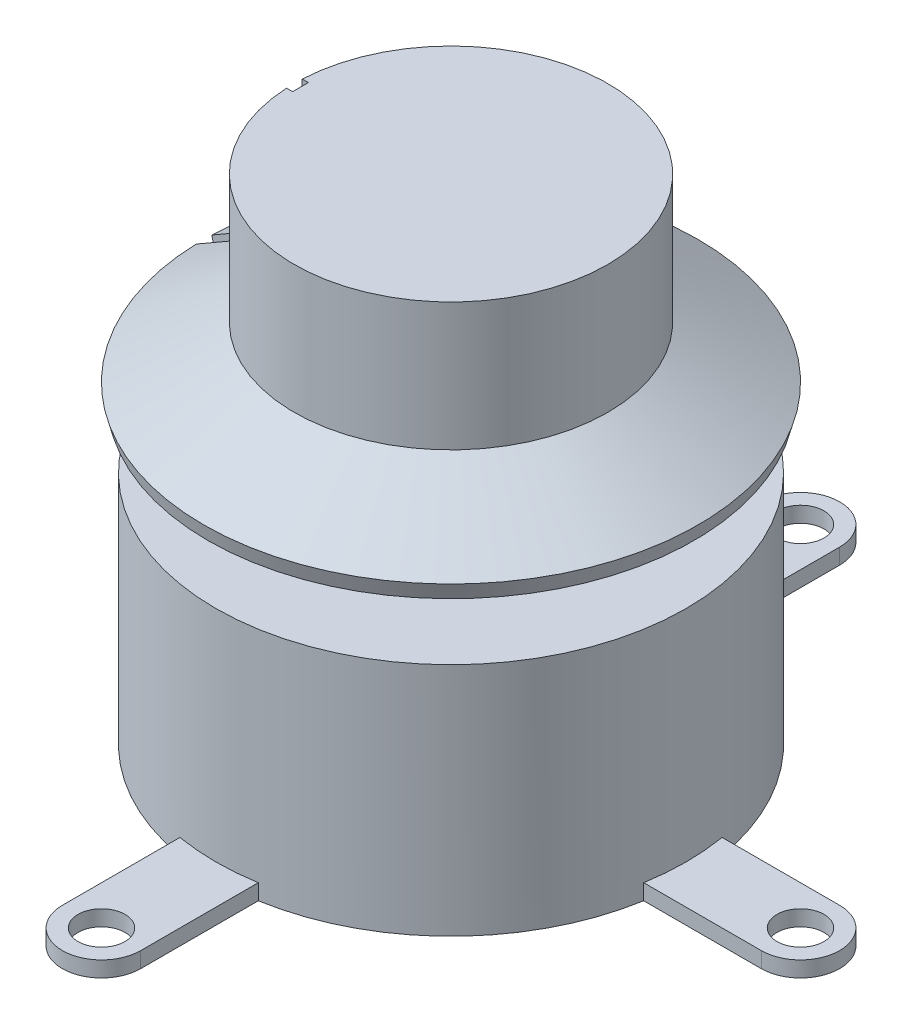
from build123d import *

# Parameters (mm, degrees)
SKETCH1_R          = 19.05
EXTRUDE1_DEPTH     = 19.05
SKETCH2_R          = 1.905
EXTRUDE2_DEPTH     = 1.27
CUT_EXTRUDE1_DEPTH = 0.254
SKETCH4_R          = 3.048
EXTRUDE3_DEPTH     = 19.05
CUT_EXTRUDE2_DEPTH = 0.635


with BuildPart() as part:
    # Sketch1 → Extrude1 (new body)
    with BuildSketch(Plane(origin=(0, 0, 0), x_dir=(1, 0, 0), z_dir=(0, 1, 0))):
        with Locations(Location((0, 0, 0), (0, 0, 90))):
            Circle(SKETCH1_R)
    extrude(amount=EXTRUDE1_DEPTH)

    # Sketch2 → Extrude2 (add)
    # profile 1 of 3: a face of its own
    with BuildSketch(Plane.XZ):
        with BuildLine():
            Line((3.175, 28.308553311), (3.175, 18.783553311))
            Line((3.175, 18.783553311), (-3.175, 18.783553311))
            Line((-3.175, 18.783553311), (-3.175, 28.308553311))
            ThreePointArc((-3.175, 28.308553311), (0, 31.483553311), (3.175, 28.308553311))
        make_face()
        with Locations(Location((0, 28.308553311, 0), (0, 0, 270))):
            Circle(SKETCH2_R, mode=Mode.SUBTRACT)
    # profile 2 of 3: a face of its own
    with BuildSketch(Plane.XZ):
        with BuildLine():
            Line((18.783553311, 3.175), (28.308553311, 3.175))
            ThreePointArc((28.308553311, 3.175), (31.483553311, 0), (28.308553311, -3.175))
            Line((28.308553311, -3.175), (18.783553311, -3.175))
            Line((18.783553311, -3.175), (18.783553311, 3.175))
        make_face()
        with Locations(Location((28.308553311, 0, 0), (0, 0, 270))):
            Circle(SKETCH2_R, mode=Mode.SUBTRACT)
    # profile 3 of 3: a face of its own
    with BuildSketch(Plane.XZ):
        with BuildLine():
            Line((-3.175, -28.308553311), (-3.175, -18.783553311))
            Line((-3.175, -18.783553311), (3.175, -18.783553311))
            Line((3.175, -18.783553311), (3.175, -28.308553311))
            ThreePointArc((3.175, -28.308553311), (0, -31.483553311), (-3.175, -28.308553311))
        make_face()
        with Locations(Location((0, -28.308553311, 0), (0, 0, 90))):
            Circle(SKETCH2_R, mode=Mode.SUBTRACT)
    extrude(amount=-EXTRUDE2_DEPTH)

    # Sketch3 → Cut-Extrude1 (cut)
    # profile 1 of 5: a face of its own
    with BuildSketch(Plane.XZ):
        with BuildLine():
            Line((23.052557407, -0.48546639), (23.052557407, 0.17427387))
            Line((23.052557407, 0.17427387), (24.578206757, 0.17427387))
            Line((24.578206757, 0.17427387), (24.578206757, -1.135542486))
            add(Edge.make_bspline(
                [(24.578206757, -1.135542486), (24.542279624, -1.161105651), (24.472134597, -1.21101581), (24.366806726, -1.280429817), (24.265531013, -1.34436738), (24.166864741, -1.401490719), (24.07143066, -1.452189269), (23.978950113, -1.496737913), (23.890300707, -1.53585077), (23.803099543, -1.567935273), (23.715424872, -1.594518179), (23.625130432, -1.617677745), (23.53103476, -1.637744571), (23.432989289, -1.653808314), (23.331060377, -1.665777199), (23.225151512, -1.675000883), (23.115315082, -1.679975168), (23.040750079, -1.680818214), (23.002948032, -1.681245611)],
                knots=[0, 0, 0, 0, 1.243536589, 2.427911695, 3.557294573, 4.621152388, 5.64268009, 6.60441749, 7.515896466, 8.37443551, 9.223239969, 10.098831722, 11.002894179, 11.935954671, 12.899883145, 13.896872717, 14.933782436, 16, 16, 16, 16], degree=3))
            add(Edge.make_bspline(
                [(23.002948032, -1.681245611), (22.956545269, -1.680605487), (22.865797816, -1.679353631), (22.733128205, -1.670231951), (22.607112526, -1.655509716), (22.487608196, -1.635214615), (22.37467596, -1.608071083), (22.268118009, -1.575248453), (22.167898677, -1.536954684), (22.074630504, -1.491400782), (21.987120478, -1.440133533), (21.904531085, -1.383449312), (21.826921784, -1.321040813), (21.755245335, -1.251840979), (21.687332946, -1.178209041), (21.625417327, -1.097781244), (21.568686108, -1.011686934), (21.516608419, -0.920541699), (21.470241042, -0.824571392), (21.430177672, -0.724471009), (21.397031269, -0.620761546), (21.369102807, -0.513904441), (21.347103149, -0.403577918), (21.331814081, -0.289529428), (21.322706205, -0.172067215), (21.321400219, -0.092687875), (21.320739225, -0.052511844)],
                knots=[0, 0, 0, 0, 1.253917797, 2.452221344, 3.591772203, 4.681385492, 5.725859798, 6.728156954, 7.692763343, 8.621995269, 9.52977499, 10.431262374, 11.326770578, 12.217527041, 13.121290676, 14.03140493, 14.956950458, 15.905713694, 16.866120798, 17.834977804, 18.81688793, 19.806469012, 20.818314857, 21.854955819, 22.914335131, 24, 24, 24, 24], degree=3))
            add(Edge.make_bspline(
                [(21.320739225, -0.052511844), (21.321269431, -0.01017992), (21.322312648, 0.073111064), (21.333194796, 0.195901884), (21.349438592, 0.314550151), (21.373587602, 0.428949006), (21.403697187, 0.539185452), (21.440497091, 0.645394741), (21.484223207, 0.747350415), (21.535375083, 0.844725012), (21.592338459, 0.93730167), (21.655954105, 1.024470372), (21.726237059, 1.105465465), (21.802489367, 1.181035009), (21.884667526, 1.251263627), (21.97383445, 1.314630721), (22.068712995, 1.373329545), (22.135893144, 1.406658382), (22.169897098, 1.423528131)],
                knots=[0, 0, 0, 0, 1.125501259, 2.214501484, 3.275832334, 4.308594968, 5.321456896, 6.313082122, 7.295503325, 8.268817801, 9.235659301, 10.183814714, 11.135352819, 12.084419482, 13.036574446, 14.006582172, 14.991010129, 16, 16, 16, 16], degree=3))
            add(Edge.make_bspline(
                [(22.169897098, 1.423528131), (22.19806767, 1.435997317), (22.255686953, 1.461501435), (22.348004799, 1.492272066), (22.447240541, 1.517393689), (22.553300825, 1.539775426), (22.666505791, 1.556156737), (22.786713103, 1.567494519), (22.913735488, 1.574708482), (23.000790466, 1.575708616), (23.045470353, 1.576221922)],
                knots=[0, 0, 0, 0, 0.82525077, 1.687944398, 2.603683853, 3.567637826, 4.591578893, 5.667081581, 6.802658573, 8, 8, 8, 8], degree=3))
            add(Edge.make_bspline(
                [(23.045470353, 1.576221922), (23.08842685, 1.576046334), (23.171359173, 1.575707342), (23.291674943, 1.571093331), (23.403441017, 1.563689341), (23.506969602, 1.552501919), (23.602092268, 1.539515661), (23.688955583, 1.522651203), (23.767457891, 1.503230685), (23.859868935, 1.472093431), (23.965648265, 1.426166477), (24.081456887, 1.35655113), (24.186096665, 1.273614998), (24.278959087, 1.176488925), (24.360482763, 1.065805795), (24.431602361, 0.941796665), (24.49189948, 0.803931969), (24.52166614, 0.705514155), (24.536972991, 0.654904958)],
                knots=[0, 0, 0, 0, 1.069735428, 2.065243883, 2.998077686, 3.858639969, 4.658133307, 5.388186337, 6.061427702, 6.67030134, 7.815060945, 8.925844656, 10.025915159, 11.130462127, 12.262203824, 13.441052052, 14.684117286, 16, 16, 16, 16], degree=3))
            Line((24.536972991, 0.654904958), (23.547362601, 0.504144))
            add(Edge.make_bspline(
                [(23.547362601, 0.504144), (23.537049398, 0.529694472), (23.516794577, 0.579874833), (23.472242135, 0.646803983), (23.417667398, 0.704078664), (23.353031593, 0.751376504), (23.278935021, 0.789090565), (23.195076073, 0.815144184), (23.102167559, 0.831596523), (23.0369551, 0.833185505), (23.002948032, 0.83401413)],
                knots=[0, 0, 0, 0, 0.965951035, 1.897098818, 2.804250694, 3.732245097, 4.697223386, 5.711239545, 6.806454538, 8, 8, 8, 8], degree=3))
            add(Edge.make_bspline(
                [(23.002948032, 0.83401413), (22.977148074, 0.833416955), (22.92686129, 0.832253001), (22.853404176, 0.822554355), (22.784151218, 0.805695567), (22.718667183, 0.782487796), (22.657094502, 0.752669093), (22.599475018, 0.716550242), (22.546100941, 0.67348661), (22.497161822, 0.623860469), (22.45263946, 0.567064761), (22.414145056, 0.50257291), (22.381917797, 0.430238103), (22.355605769, 0.3505602), (22.335217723, 0.263216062), (22.320455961, 0.168474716), (22.312381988, 0.065960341), (22.311044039, -0.00482172), (22.310349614, -0.041559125)],
                knots=[0, 0, 0, 0, 0.97489115, 1.900163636, 2.793961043, 3.664304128, 4.521066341, 5.37459257, 6.229006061, 7.107186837, 8.003487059, 8.950089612, 9.938271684, 10.990674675, 12.116840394, 13.324563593, 14.611391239, 16, 16, 16, 16], degree=3))
            add(Edge.make_bspline(
                [(22.310349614, -0.041559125), (22.310983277, -0.080447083), (22.312203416, -0.155327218), (22.321053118, -0.263414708), (22.336450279, -0.3628747), (22.357402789, -0.453887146), (22.384281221, -0.536504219), (22.417772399, -0.610554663), (22.457667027, -0.676050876), (22.503969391, -0.732953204), (22.556126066, -0.781397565), (22.612675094, -0.823430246), (22.673520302, -0.860305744), (22.740130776, -0.888680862), (22.811031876, -0.911635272), (22.886625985, -0.927412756), (22.967032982, -0.937341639), (23.022245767, -0.938461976), (23.050624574, -0.939037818)],
                knots=[0, 0, 0, 0, 1.399302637, 2.694406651, 3.898885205, 5.01797942, 6.051713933, 7.020030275, 7.935888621, 8.803699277, 9.651141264, 10.49040411, 11.335976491, 12.204612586, 13.089325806, 14.013913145, 14.979171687, 16, 16, 16, 16], degree=3))
            add(Edge.make_bspline(
                [(23.050624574, -0.939037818), (23.07792492, -0.938621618), (23.132227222, -0.937793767), (23.212422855, -0.928757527), (23.290919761, -0.916369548), (23.368402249, -0.897109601), (23.447627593, -0.87120133), (23.531399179, -0.839005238), (23.620545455, -0.798771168), (23.680867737, -0.767727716), (23.712297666, -0.751553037)],
                knots=[0, 0, 0, 0, 0.941933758, 1.873572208, 2.782730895, 3.683509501, 4.625939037, 5.658467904, 6.779983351, 8, 8, 8, 8], degree=3))
            Line((23.712297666, -0.751553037), (23.712297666, -0.48546639))
            Line((23.712297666, -0.48546639), (23.052557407, -0.48546639))
        make_face()
    # profile 2 of 5: a face of its own
    with BuildSketch(Plane.XZ):
        with BuildLine():
            Line((0.619097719, 22.529732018), (1.48500681, 22.269443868))
            add(Edge.make_bspline(
                [(1.48500681, 22.269443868), (1.477549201, 22.239731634), (1.462813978, 22.181024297), (1.436273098, 22.095483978), (1.406990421, 22.013612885), (1.373385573, 21.935970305), (1.338828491, 21.861114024), (1.299000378, 21.791017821), (1.257092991, 21.72420367), (1.197689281, 21.640881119), (1.115208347, 21.545630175), (1.004752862, 21.445022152), (0.882276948, 21.359940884), (0.771410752, 21.301692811), (0.676488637, 21.263172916), (0.599967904, 21.238217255), (0.519218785, 21.216195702), (0.433309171, 21.198881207), (0.342967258, 21.18557192), (0.247733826, 21.175937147), (0.147990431, 21.170075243), (0.079845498, 21.169375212), (0.04504638, 21.169017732)],
                knots=[0, 0, 0, 0, 0.924244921, 1.826182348, 2.701535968, 3.546520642, 4.378482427, 5.187954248, 5.977251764, 6.757720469, 8.273918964, 9.769591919, 11.254542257, 12.76187881, 13.538084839, 14.343473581, 15.189228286, 16.062372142, 16.986208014, 17.943795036, 18.949971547, 20, 20, 20, 20], degree=3))
            add(Edge.make_bspline(
                [(0.04504638, 21.169017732), (0.002731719, 21.169604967), (-0.079798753, 21.170750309), (-0.200631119, 21.176974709), (-0.315490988, 21.188354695), (-0.424374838, 21.205461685), (-0.5278035, 21.225529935), (-0.625018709, 21.251352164), (-0.716273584, 21.281649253), (-0.802143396, 21.316525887), (-0.883869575, 21.357428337), (-0.96153573, 21.406035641), (-1.037011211, 21.461010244), (-1.108857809, 21.523859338), (-1.178717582, 21.59301026), (-1.246057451, 21.669128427), (-1.309280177, 21.75330147), (-1.370924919, 21.843080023), (-1.427019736, 21.940076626), (-1.475538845, 22.044409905), (-1.515866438, 22.155580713), (-1.549217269, 22.272959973), (-1.575876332, 22.396652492), (-1.594282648, 22.527124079), (-1.605231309, 22.664197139), (-1.606751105, 22.757785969), (-1.607525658, 22.805482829)],
                knots=[0, 0, 0, 0, 1.147650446, 2.238376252, 3.280413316, 4.276323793, 5.226689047, 6.13651372, 7.002182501, 7.832854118, 8.648150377, 9.477309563, 10.314915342, 11.177895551, 12.063382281, 12.979505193, 13.931243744, 14.916675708, 15.931699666, 16.966189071, 18.033078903, 19.13554484, 20.273354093, 21.461953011, 22.706502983, 24, 24, 24, 24], degree=3))
            add(Edge.make_bspline(
                [(-1.607525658, 22.805482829), (-1.606442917, 22.868683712), (-1.604334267, 22.991768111), (-1.583535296, 23.170709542), (-1.55220994, 23.338862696), (-1.50654327, 23.495702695), (-1.446953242, 23.640610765), (-1.375324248, 23.774767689), (-1.289616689, 23.897141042), (-1.191491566, 24.008471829), (-1.081073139, 24.107140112), (-0.959524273, 24.19285019), (-0.827041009, 24.265434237), (-0.683719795, 24.324482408), (-0.529555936, 24.370407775), (-0.36473546, 24.402717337), (-0.189128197, 24.423214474), (-0.0684054, 24.425376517), (-0.006495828, 24.426485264)],
                knots=[0, 0, 0, 0, 1.16882947, 2.276307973, 3.328298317, 4.330369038, 5.292534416, 6.222298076, 7.138273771, 8.050302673, 8.962002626, 9.87147472, 10.796156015, 11.750975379, 12.733998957, 13.767258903, 14.854996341, 16, 16, 16, 16], degree=3))
            add(Edge.make_bspline(
                [(-0.006495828, 24.426485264), (0.042062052, 24.425773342), (0.136745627, 24.424385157), (0.274706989, 24.412747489), (0.404612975, 24.393297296), (0.526802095, 24.367626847), (0.640531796, 24.33231332), (0.747016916, 24.290889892), (0.844977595, 24.240398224), (0.935779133, 24.182614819), (1.019064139, 24.116284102), (1.096998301, 24.042609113), (1.168505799, 23.959873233), (1.235898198, 23.869953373), (1.296247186, 23.770511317), (1.351624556, 23.663564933), (1.401524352, 23.548357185), (1.429475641, 23.467781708), (1.443773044, 23.426566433)],
                knots=[0, 0, 0, 0, 1.217751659, 2.374508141, 3.469163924, 4.51086882, 5.502490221, 6.452709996, 7.372946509, 8.261977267, 9.147787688, 10.039327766, 10.947855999, 11.887251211, 12.85447837, 13.861487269, 14.906126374, 16, 16, 16, 16], degree=3))
            Line((1.443773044, 23.426566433), (0.577863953, 23.230706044))
            add(Edge.make_bspline(
                [(0.577863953, 23.230706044), (0.570652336, 23.253793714), (0.55717183, 23.29695095), (0.533795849, 23.355849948), (0.510649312, 23.405460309), (0.492252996, 23.433605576), (0.483799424, 23.446539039)],
                knots=[0, 0, 0, 0, 1.227562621, 2.294653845, 3.216350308, 4, 4, 4, 4], degree=3))
            add(Edge.make_bspline(
                [(0.483799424, 23.446539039), (0.469859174, 23.464963), (0.442432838, 23.501210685), (0.393954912, 23.548426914), (0.341516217, 23.589396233), (0.284643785, 23.623613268), (0.223739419, 23.651011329), (0.158942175, 23.670167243), (0.090804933, 23.682166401), (0.044237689, 23.683565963), (0.020563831, 23.684277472)],
                knots=[0, 0, 0, 0, 1.022346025, 2.011384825, 2.987756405, 3.965193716, 4.94480522, 5.938182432, 6.9518131, 8, 8, 8, 8], degree=3))
            add(Edge.make_bspline(
                [(0.020563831, 23.684277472), (-0.006115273, 23.683617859), (-0.058267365, 23.682328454), (-0.13400839, 23.669850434), (-0.205071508, 23.649259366), (-0.271161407, 23.619882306), (-0.332994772, 23.583148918), (-0.38943772, 23.53747367), (-0.440768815, 23.483564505), (-0.470192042, 23.442827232), (-0.485194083, 23.42205649)],
                knots=[0, 0, 0, 0, 1.074844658, 2.101097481, 3.084644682, 4.049882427, 5.009082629, 5.975872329, 6.967956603, 8, 8, 8, 8], degree=3))
            add(Edge.make_bspline(
                [(-0.485194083, 23.42205649), (-0.495913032, 23.404882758), (-0.518145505, 23.369262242), (-0.544459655, 23.309464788), (-0.568233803, 23.243585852), (-0.585359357, 23.170133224), (-0.600638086, 23.090269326), (-0.61032816, 23.003033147), (-0.617100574, 22.909104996), (-0.617637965, 22.844153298), (-0.617915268, 22.81063705)],
                knots=[0, 0, 0, 0, 0.765245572, 1.587217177, 2.466349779, 3.412541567, 4.437552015, 5.542455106, 6.731862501, 8, 8, 8, 8], degree=3))
            add(Edge.make_bspline(
                [(-0.617915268, 22.81063705), (-0.617382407, 22.769181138), (-0.616362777, 22.689855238), (-0.609738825, 22.575805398), (-0.596712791, 22.471949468), (-0.57970152, 22.378061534), (-0.558279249, 22.293899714), (-0.530510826, 22.220399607), (-0.498753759, 22.156258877), (-0.460512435, 22.102501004), (-0.418119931, 22.057006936), (-0.371888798, 22.017738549), (-0.321433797, 21.985124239), (-0.267498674, 21.957390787), (-0.208874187, 21.936964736), (-0.146448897, 21.922373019), (-0.080004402, 21.913052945), (-0.034446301, 21.911846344), (-0.011005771, 21.911225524)],
                knots=[0, 0, 0, 0, 1.602188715, 3.065788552, 4.412313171, 5.644618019, 6.751844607, 7.7630822, 8.676201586, 9.50981682, 10.302645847, 11.074162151, 11.847640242, 12.619692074, 13.412477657, 14.239872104, 15.094379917, 16, 16, 16, 16], degree=3))
            add(Edge.make_bspline(
                [(-0.011005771, 21.911225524), (0.011557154, 21.911776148), (0.055509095, 21.912848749), (0.119458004, 21.919540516), (0.178903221, 21.932655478), (0.234121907, 21.950096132), (0.28536381, 21.971784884), (0.332147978, 21.999023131), (0.37449084, 22.031614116), (0.412520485, 22.069431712), (0.447535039, 22.111467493), (0.479020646, 22.158452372), (0.508655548, 22.209483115), (0.536366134, 22.264619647), (0.560999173, 22.324529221), (0.582371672, 22.388870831), (0.602899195, 22.457464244), (0.613593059, 22.505173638), (0.619097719, 22.529732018)],
                knots=[0, 0, 0, 0, 1.110419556, 2.163065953, 3.158007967, 4.100495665, 5.00938437, 5.890256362, 6.756877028, 7.631195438, 8.524217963, 9.444584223, 10.410653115, 11.426752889, 12.478656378, 13.594843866, 14.761947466, 16, 16, 16, 16], degree=3))
        make_face()
    # profile 3 of 5: a face of its own
    with BuildSketch(Plane.XZ):
        with BuildLine():
            add(Edge.make_bspline(
                [(-3.424896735, -15.792068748), (-3.423706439, -15.749284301), (-3.421371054, -15.665340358), (-3.405294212, -15.542454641), (-3.37752687, -15.425385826), (-3.337906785, -15.31438067), (-3.288212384, -15.208630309), (-3.227289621, -15.108669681), (-3.154556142, -15.01502008), (-3.071523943, -14.92756221), (-2.979316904, -14.847795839), (-2.878171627, -14.778453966), (-2.769124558, -14.720295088), (-2.652525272, -14.672566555), (-2.528304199, -14.6349938), (-2.396204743, -14.609112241), (-2.256605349, -14.592425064), (-2.160873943, -14.590719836), (-2.111858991, -14.589846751)],
                knots=[0, 0, 0, 0, 1.025367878, 2.01179234, 2.964384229, 3.903756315, 4.831677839, 5.760369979, 6.703457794, 7.668319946, 8.646477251, 9.620195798, 10.601220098, 11.602983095, 12.635381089, 13.706436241, 14.825684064, 16, 16, 16, 16], degree=3))
            add(Edge.make_bspline(
                [(-2.111858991, -14.589846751), (-2.055963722, -14.591041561), (-1.947496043, -14.593360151), (-1.790139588, -14.612454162), (-1.643210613, -14.642686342), (-1.506978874, -14.6867671), (-1.381085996, -14.742900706), (-1.265537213, -14.811427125), (-1.160462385, -14.892896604), (-1.09979653, -14.956703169), (-1.069417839, -14.988654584)],
                knots=[0, 0, 0, 0, 1.164847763, 2.260447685, 3.299169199, 4.287372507, 5.239221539, 6.166701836, 7.081967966, 8, 8, 8, 8], degree=3))
            add(Edge.make_bspline(
                [(-1.069417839, -14.988654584), (-1.04679811, -15.015755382), (-1.001840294, -15.069619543), (-0.943498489, -15.156997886), (-0.89535445, -15.249775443), (-0.85498422, -15.34664691), (-0.824312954, -15.448405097), (-0.801405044, -15.55432873), (-0.788623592, -15.665261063), (-0.786843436, -15.740710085), (-0.785935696, -15.779183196)],
                knots=[0, 0, 0, 0, 0.985651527, 1.959030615, 2.927758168, 3.901488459, 4.886409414, 5.892444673, 6.925311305, 8, 8, 8, 8], degree=3))
            add(Edge.make_bspline(
                [(-0.785935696, -15.779183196), (-0.787129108, -15.822180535), (-0.789470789, -15.906548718), (-0.805533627, -16.030305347), (-0.833449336, -16.147794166), (-0.871460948, -16.259856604), (-0.921252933, -16.365676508), (-0.982085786, -16.465553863), (-1.054535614, -16.558837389), (-1.136521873, -16.646240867), (-1.228387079, -16.725597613), (-1.329782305, -16.794125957), (-1.439151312, -16.852516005), (-1.557275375, -16.899423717), (-1.683498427, -16.936170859), (-1.818272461, -16.962287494), (-1.961331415, -16.978792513), (-2.059625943, -16.980520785), (-2.109926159, -16.981405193)],
                knots=[0, 0, 0, 0, 1.023611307, 2.008501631, 2.964665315, 3.894380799, 4.820716, 5.743191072, 6.672794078, 7.627685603, 8.592084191, 9.556401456, 10.535368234, 11.537975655, 12.576709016, 13.660652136, 14.802886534, 16, 16, 16, 16], degree=3))
            add(Edge.make_bspline(
                [(-2.109926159, -16.981405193), (-2.155056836, -16.980527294), (-2.24314579, -16.978813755), (-2.371957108, -16.965802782), (-2.494185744, -16.944155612), (-2.609818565, -16.913011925), (-2.719243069, -16.874122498), (-2.821387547, -16.82518354), (-2.91782046, -16.76890484), (-2.976287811, -16.723705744), (-3.005472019, -16.701144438)],
                knots=[0, 0, 0, 0, 1.131304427, 2.208152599, 3.242096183, 4.239912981, 5.2072978, 6.148974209, 7.076053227, 8, 8, 8, 8], degree=3))
            add(Edge.make_bspline(
                [(-3.005472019, -16.701144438), (-3.039043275, -16.671811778), (-3.104959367, -16.614218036), (-3.190403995, -16.516312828), (-3.263182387, -16.412377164), (-3.322087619, -16.3012454), (-3.368286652, -16.183690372), (-3.400901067, -16.059144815), (-3.421556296, -15.927841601), (-3.423769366, -15.837890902), (-3.424896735, -15.792068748)],
                knots=[0, 0, 0, 0, 1.031322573, 2.024968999, 3.000290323, 3.963582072, 4.930461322, 5.918379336, 6.939593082, 8, 8, 8, 8], degree=3))
        make_face()
        with BuildLine():
            add(Edge.make_bspline(
                [(-2.517753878, -15.784337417), (-2.517321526, -15.808180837), (-2.516483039, -15.854421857), (-2.511796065, -15.921442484), (-2.501899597, -15.983370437), (-2.489088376, -16.040438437), (-2.473159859, -16.092957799), (-2.453353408, -16.140812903), (-2.429304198, -16.183812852), (-2.401722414, -16.221811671), (-2.370919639, -16.254728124), (-2.339066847, -16.284068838), (-2.304192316, -16.308169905), (-2.267835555, -16.327852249), (-2.229765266, -16.343975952), (-2.189592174, -16.354447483), (-2.147591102, -16.362208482), (-2.118769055, -16.362666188), (-2.10412766, -16.362898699)],
                knots=[0, 0, 0, 0, 1.428609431, 2.770590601, 4.020679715, 5.181729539, 6.272354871, 7.30457834, 8.278041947, 9.217323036, 10.109609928, 10.975058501, 11.806661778, 12.641443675, 13.449013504, 14.276126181, 15.124284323, 16, 16, 16, 16], degree=3))
            add(Edge.make_bspline(
                [(-2.10412766, -16.362898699), (-2.089481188, -16.362684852), (-2.060649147, -16.362263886), (-2.01877501, -16.354246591), (-1.978196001, -16.344720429), (-1.940311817, -16.328558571), (-1.903567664, -16.309739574), (-1.870485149, -16.284269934), (-1.8374676, -16.257024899), (-1.80813387, -16.223646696), (-1.780505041, -16.186064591), (-1.75705179, -16.142838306), (-1.736738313, -16.094561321), (-1.721115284, -16.040845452), (-1.708096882, -15.982131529), (-1.699248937, -15.917931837), (-1.694290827, -15.848630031), (-1.693490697, -15.800667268), (-1.693078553, -15.775961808)],
                knots=[0, 0, 0, 0, 0.867200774, 1.707111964, 2.522905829, 3.334410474, 4.143812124, 4.964367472, 5.804568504, 6.679595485, 7.591947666, 8.567079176, 9.589265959, 10.69366012, 11.880722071, 13.154586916, 14.534337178, 16, 16, 16, 16], degree=3))
            add(Edge.make_bspline(
                [(-1.693078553, -15.775961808), (-1.693477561, -15.752758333), (-1.69424706, -15.708009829), (-1.69935238, -15.643004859), (-1.708113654, -15.582666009), (-1.721062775, -15.526631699), (-1.737677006, -15.475334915), (-1.757570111, -15.428307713), (-1.781588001, -15.38632048), (-1.808621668, -15.34855017), (-1.839018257, -15.316042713), (-1.87083295, -15.287219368), (-1.904289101, -15.262828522), (-1.939366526, -15.242105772), (-1.977036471, -15.227767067), (-2.016026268, -15.216693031), (-2.056589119, -15.209109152), (-2.084335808, -15.208606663), (-2.098329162, -15.208353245)],
                knots=[0, 0, 0, 0, 1.421292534, 2.740999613, 3.991213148, 5.15273704, 6.259325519, 7.290549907, 8.274455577, 9.216488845, 10.128845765, 10.995182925, 11.84243298, 12.661539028, 13.482333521, 14.302706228, 15.144012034, 16, 16, 16, 16], degree=3))
            add(Edge.make_bspline(
                [(-2.098329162, -15.208353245), (-2.113183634, -15.208588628), (-2.142429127, -15.20905205), (-2.185088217, -15.216774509), (-2.226033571, -15.227434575), (-2.264960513, -15.243076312), (-2.30188846, -15.263227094), (-2.336878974, -15.287669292), (-2.369209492, -15.317372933), (-2.400239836, -15.350490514), (-2.428071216, -15.388702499), (-2.451790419, -15.43172697), (-2.472706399, -15.479032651), (-2.489048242, -15.531179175), (-2.502134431, -15.587813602), (-2.510705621, -15.649265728), (-2.516766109, -15.715279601), (-2.517418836, -15.76091366), (-2.517753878, -15.784337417)],
                knots=[0, 0, 0, 0, 0.886888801, 1.746107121, 2.584046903, 3.413878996, 4.247082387, 5.094999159, 5.958811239, 6.867556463, 7.805061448, 8.776684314, 9.800211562, 10.892630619, 12.038966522, 13.272068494, 14.599765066, 16, 16, 16, 16], degree=3))
        make_face(mode=Mode.SUBTRACT)
    # profile 4 of 5: a face of its own
    with BuildSketch(Plane.XZ):
        with BuildLine():
            Line((2.059194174, -16.940171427), (1.250625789, -16.940171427))
            Line((1.250625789, -16.940171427), (1.250625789, -16.554249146))
            add(Edge.make_bspline(
                [(1.250625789, -16.554249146), (1.220392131, -16.59074092), (1.162523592, -16.660587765), (1.068224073, -16.751265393), (0.9742289, -16.826334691), (0.877571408, -16.885624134), (0.774507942, -16.928967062), (0.663081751, -16.959872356), (0.540559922, -16.977745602), (0.455432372, -16.980152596), (0.41113208, -16.981405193)],
                knots=[0, 0, 0, 0, 1.15820774, 2.216860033, 3.193027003, 4.095612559, 4.980464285, 5.918394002, 6.916734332, 8, 8, 8, 8], degree=3))
            add(Edge.make_bspline(
                [(0.41113208, -16.981405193), (0.381245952, -16.980886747), (0.323002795, -16.97987638), (0.238323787, -16.969135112), (0.158601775, -16.952782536), (0.083853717, -16.928798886), (0.014040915, -16.897618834), (-0.051268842, -16.860505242), (-0.111215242, -16.815984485), (-0.166220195, -16.765079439), (-0.215611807, -16.706646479), (-0.258279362, -16.640617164), (-0.293419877, -16.566941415), (-0.323578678, -16.486720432), (-0.345339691, -16.398601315), (-0.362390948, -16.303754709), (-0.371848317, -16.201376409), (-0.37300151, -16.130762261), (-0.373598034, -16.094234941)],
                knots=[0, 0, 0, 0, 1.06053871, 2.066815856, 3.025395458, 3.946519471, 4.847671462, 5.735728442, 6.608031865, 7.492842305, 8.391021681, 9.317369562, 10.275615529, 11.284056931, 12.35482497, 13.493073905, 14.703216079, 16, 16, 16, 16], degree=3))
            Line((-0.373598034, -16.094234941), (-0.373598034, -14.631080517))
            Line((-0.373598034, -14.631080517), (0.492311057, -14.631080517))
            Line((0.492311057, -14.631080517), (0.492311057, -15.885489))
            add(Edge.make_bspline(
                [(0.492311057, -15.885489), (0.49252741, -15.902680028), (0.492944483, -15.93581996), (0.497000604, -15.98377077), (0.502839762, -16.028077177), (0.513007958, -16.06814714), (0.524014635, -16.104762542), (0.539230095, -16.136836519), (0.555692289, -16.16592764), (0.582496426, -16.198175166), (0.622165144, -16.231831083), (0.678847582, -16.260481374), (0.744129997, -16.277363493), (0.790292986, -16.279377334), (0.814449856, -16.280431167)],
                knots=[0, 0, 0, 0, 1.0582157, 2.039970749, 2.9619292, 3.805443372, 4.583276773, 5.31105352, 5.986879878, 6.635374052, 7.88323301, 9.160659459, 10.514186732, 12, 12, 12, 12], degree=3))
            add(Edge.make_bspline(
                [(0.814449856, -16.280431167), (0.841037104, -16.278995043), (0.8928686, -16.27619534), (0.966670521, -16.25280123), (1.032638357, -16.214536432), (1.080195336, -16.170505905), (1.113849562, -16.127540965), (1.134496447, -16.087417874), (1.15352045, -16.042381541), (1.168005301, -15.990809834), (1.179387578, -15.933501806), (1.187828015, -15.870244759), (1.19190664, -15.801141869), (1.192813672, -15.753201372), (1.193285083, -15.728285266)],
                knots=[0, 0, 0, 0, 1.256077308, 2.448706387, 3.623664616, 4.839285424, 5.491827, 6.196725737, 6.966827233, 7.803101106, 8.725990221, 9.730763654, 10.820610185, 12, 12, 12, 12], degree=3))
            Line((1.193285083, -15.728285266), (1.193285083, -14.631080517))
            Line((1.193285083, -14.631080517), (2.059194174, -14.631080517))
            Line((2.059194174, -14.631080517), (2.059194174, -16.940171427))
        make_face()
    # profile 5 of 5: a face of its own
    with BuildSketch(Plane.XZ):
        with BuildLine():
            Line((3.667311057, -13.765171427), (3.667311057, -14.631080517))
            Line((3.667311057, -14.631080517), (4.162116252, -14.631080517))
            Line((4.162116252, -14.631080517), (4.162116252, -15.290820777))
            Line((4.162116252, -15.290820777), (3.667311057, -15.290820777))
            Line((3.667311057, -15.290820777), (3.667311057, -16.097456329))
            add(Edge.make_bspline(
                [(3.667311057, -16.097456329), (3.667659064, -16.119600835), (3.668295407, -16.160092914), (3.673176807, -16.214544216), (3.680664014, -16.257708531), (3.691600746, -16.28035663), (3.696303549, -16.290095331)],
                knots=[0, 0, 0, 0, 1.351083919, 2.470508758, 3.342317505, 4, 4, 4, 4], degree=3))
            add(Edge.make_bspline(
                [(3.696303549, -16.290095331), (3.704761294, -16.301175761), (3.721724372, -16.323398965), (3.758527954, -16.347419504), (3.8036512, -16.360676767), (3.836233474, -16.362128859), (3.853507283, -16.362898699)],
                knots=[0, 0, 0, 0, 0.91896383, 1.843098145, 2.856497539, 4, 4, 4, 4], degree=3))
            add(Edge.make_bspline(
                [(3.853507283, -16.362898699), (3.872023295, -16.362263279), (3.912765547, -16.360865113), (3.978367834, -16.348149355), (4.054589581, -16.332242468), (4.107894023, -16.316104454), (4.136345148, -16.307490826)],
                knots=[0, 0, 0, 0, 0.76794577, 1.689772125, 2.766921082, 4, 4, 4, 4], degree=3))
            Line((4.136345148, -16.307490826), (4.203350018, -16.910534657))
            add(Edge.make_bspline(
                [(4.203350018, -16.910534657), (4.149762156, -16.921432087), (4.044939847, -16.942748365), (3.889150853, -16.964142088), (3.739102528, -16.978695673), (3.640713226, -16.980515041), (3.592574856, -16.981405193)],
                knots=[0, 0, 0, 0, 1.065123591, 2.083470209, 3.062310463, 4, 4, 4, 4], degree=3))
            add(Edge.make_bspline(
                [(3.592574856, -16.981405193), (3.565939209, -16.981180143), (3.514570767, -16.98074612), (3.440210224, -16.976810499), (3.371389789, -16.970609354), (3.307776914, -16.961428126), (3.249452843, -16.950538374), (3.196944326, -16.935215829), (3.149551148, -16.918833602), (3.094156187, -16.893302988), (3.032554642, -16.853562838), (2.969755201, -16.793905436), (2.915731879, -16.724607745), (2.880372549, -16.657688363), (2.85744561, -16.596992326), (2.842162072, -16.544223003), (2.829401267, -16.484790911), (2.81943278, -16.418910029), (2.810942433, -16.346732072), (2.80529493, -16.267838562), (2.802256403, -16.182310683), (2.80169352, -16.123015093), (2.801401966, -16.092302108)],
                knots=[0, 0, 0, 0, 1.135841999, 2.190539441, 3.174804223, 4.081481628, 4.931082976, 5.70227561, 6.412010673, 7.067682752, 8.29980854, 9.51796668, 10.745385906, 12.031931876, 12.72764094, 13.510171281, 14.372463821, 15.318087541, 16.350762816, 17.471175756, 18.690159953, 20, 20, 20, 20], degree=3))
            Line((2.801401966, -16.092302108), (2.801401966, -15.290820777))
            Line((2.801401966, -15.290820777), (2.471531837, -15.290820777))
            Line((2.471531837, -15.290820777), (2.471531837, -14.631080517))
            Line((2.471531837, -14.631080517), (2.801401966, -14.631080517))
            Line((2.801401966, -14.631080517), (2.801401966, -14.212944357))
            Line((2.801401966, -14.212944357), (3.667311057, -13.765171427))
        make_face()
    extrude(amount=-CUT_EXTRUDE1_DEPTH, mode=Mode.SUBTRACT)

    # Sketch4 → Extrude3 (add)
    with BuildSketch(Plane(origin=(0, 19.05, 0), x_dir=(-1, 0, 0), z_dir=(0, 1, 0))):
        with Locations(Location((0, 0, 0), (0, 0, 270))):
            Circle(SKETCH4_R)
    extrude(amount=EXTRUDE3_DEPTH)

    # Sketch5 → Revolve1 (revolve)
    with BuildSketch(Plane.XY, mode=Mode.PRIVATE) as revolve1_sk:
        Polygon((0, 40.005), (-12.7, 40.005), (-12.7, 29.629261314), (-20.025295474, 25.4), (-19.685, 24.13), (0, 24.13), align=None)
    revolve(revolve1_sk.sketch.rotate(Axis((0, 40.005, 0), (0, -1, 0)), 270), axis=Axis((0, 40.005, 0), (0, -1, 0)))

    # Sketch6 → Cut-Extrude2 (cut, symmetric)
    with BuildSketch(Plane.XY):
        Polygon((-12.192, 29.335967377), (-19.889177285, 24.892), (-20.025295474, 25.4), (-12.7, 29.629261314), (-12.7, 40.005), (-12.192, 40.005), align=None)
    extrude(amount=CUT_EXTRUDE2_DEPTH, both=True, mode=Mode.SUBTRACT)


solid = part.part
